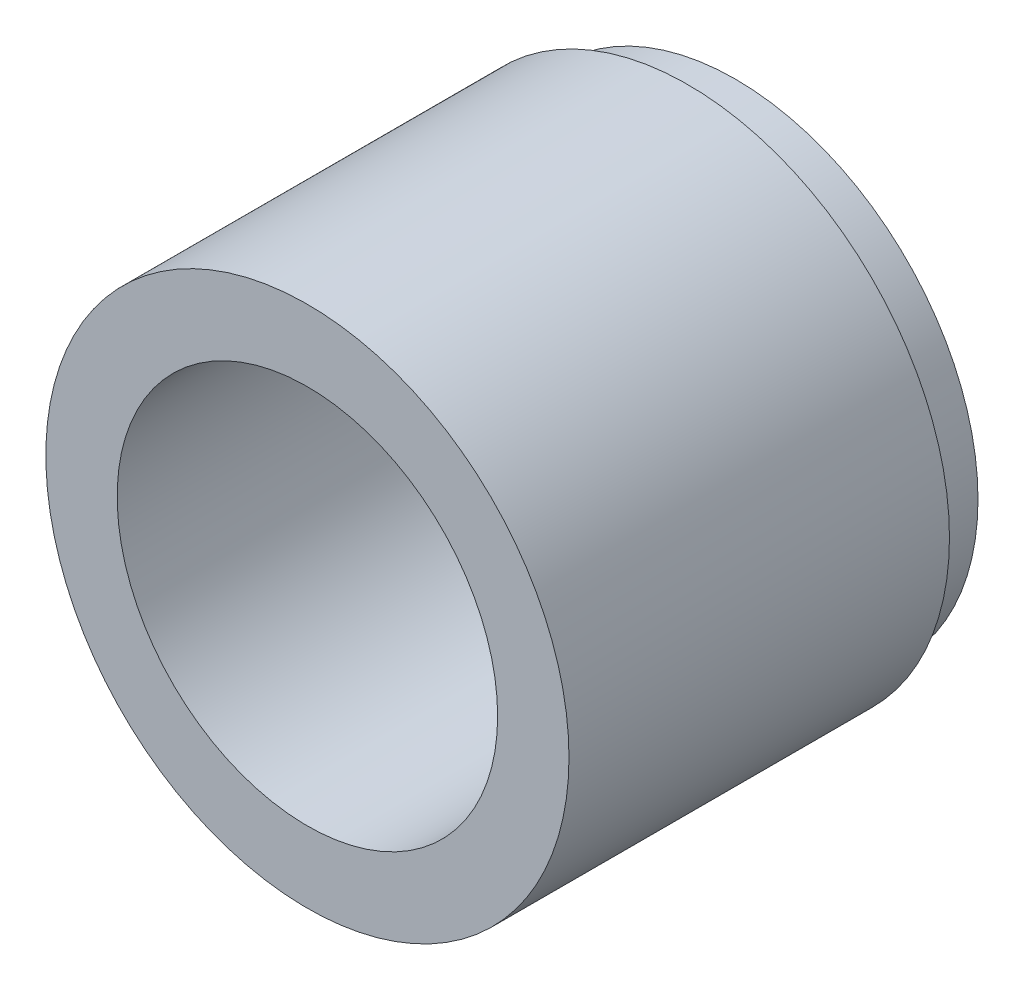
ISO-10303-21;
HEADER;
FILE_DESCRIPTION(('STEP AP214'),'2;1');
FILE_NAME('part.step','',(''),(''),'','','');
FILE_SCHEMA(('AUTOMOTIVE_DESIGN { 1 0 10303 214 1 1 1 1 }'));
ENDSEC;
DATA;
#1=APPLICATION_CONTEXT('core data for automotive mechanical design processes');
#2=APPLICATION_PROTOCOL_DEFINITION('international standard','automotive_design',2000,#1);
#3=PRODUCT_CONTEXT('',#1,'mechanical');
#4=PRODUCT('Part','Part','',(#3));
#5=PRODUCT_RELATED_PRODUCT_CATEGORY('part','',(#4));
#6=PRODUCT_DEFINITION_FORMATION('','',#4);
#7=PRODUCT_DEFINITION_CONTEXT('part definition',#1,'design');
#8=PRODUCT_DEFINITION('design','',#6,#7);
#9=PRODUCT_DEFINITION_SHAPE('','',#8);
#10=(LENGTH_UNIT() NAMED_UNIT(*) SI_UNIT(.MILLI.,.METRE.));
#11=(NAMED_UNIT(*) PLANE_ANGLE_UNIT() SI_UNIT($,.RADIAN.));
#12=(NAMED_UNIT(*) SI_UNIT($,.STERADIAN.) SOLID_ANGLE_UNIT());
#13=UNCERTAINTY_MEASURE_WITH_UNIT(LENGTH_MEASURE(1.E-05),#10,'distance_accuracy_value','');
#14=(GEOMETRIC_REPRESENTATION_CONTEXT(3) GLOBAL_UNCERTAINTY_ASSIGNED_CONTEXT((#13)) GLOBAL_UNIT_ASSIGNED_CONTEXT((#10,
#11,#12)) REPRESENTATION_CONTEXT('',''));
#15=CARTESIAN_POINT('',(0.,0.,0.));
#16=DIRECTION('',(0.,0.,1.));
#17=DIRECTION('',(1.,0.,0.));
#18=AXIS2_PLACEMENT_3D('',#15,#16,#17);
#19=CARTESIAN_POINT('',(0.,0.,40.));
#20=DIRECTION('',(0.,0.,-1.));
#21=DIRECTION('',(-1.,0.,0.));
#22=AXIS2_PLACEMENT_3D('',#19,#20,#21);
#23=CYLINDRICAL_SURFACE('',#22,27.5);
#24=CARTESIAN_POINT('',(0.,0.,40.));
#25=DIRECTION('',(0.,0.,1.));
#26=DIRECTION('',(1.,0.,0.));
#27=AXIS2_PLACEMENT_3D('',#24,#25,#26);
#28=CIRCLE('',#27,27.5);
#29=CARTESIAN_POINT('',(27.5,0.,40.));
#30=VERTEX_POINT('',#29);
#31=EDGE_CURVE('E36',#30,#30,#28,.T.);
#32=ORIENTED_EDGE('',*,*,#31,.F.);
#33=EDGE_LOOP('',(#32));
#34=FACE_BOUND('',#33,.T.);
#35=CARTESIAN_POINT('',(0.,0.,0.));
#36=DIRECTION('',(0.,0.,1.));
#37=DIRECTION('',(1.,0.,0.));
#38=AXIS2_PLACEMENT_3D('',#35,#36,#37);
#39=CIRCLE('',#38,27.5);
#40=CARTESIAN_POINT('',(27.5,0.,0.));
#41=VERTEX_POINT('',#40);
#42=EDGE_CURVE('E40',#41,#41,#39,.T.);
#43=ORIENTED_EDGE('',*,*,#42,.T.);
#44=EDGE_LOOP('',(#43));
#45=FACE_BOUND('',#44,.T.);
#46=ADVANCED_FACE('F30',(#34,#45),#23,.T.);
#47=CARTESIAN_POINT('',(0.,0.,40.));
#48=DIRECTION('',(0.,0.,1.));
#49=DIRECTION('',(1.,0.,0.));
#50=AXIS2_PLACEMENT_3D('',#47,#48,#49);
#51=PLANE('',#50);
#52=CARTESIAN_POINT('',(0.,0.,40.));
#53=DIRECTION('',(0.,0.,1.));
#54=DIRECTION('',(1.,0.,0.));
#55=AXIS2_PLACEMENT_3D('',#52,#53,#54);
#56=CIRCLE('',#55,20.);
#57=CARTESIAN_POINT('',(20.,0.,40.));
#58=VERTEX_POINT('',#57);
#59=EDGE_CURVE('E47',#58,#58,#56,.T.);
#60=ORIENTED_EDGE('',*,*,#59,.F.);
#61=EDGE_LOOP('',(#60));
#62=FACE_BOUND('',#61,.T.);
#63=ORIENTED_EDGE('',*,*,#31,.T.);
#64=EDGE_LOOP('',(#63));
#65=FACE_BOUND('',#64,.T.);
#66=ADVANCED_FACE('F81',(#62,#65),#51,.T.);
#67=CARTESIAN_POINT('',(0.,0.,0.));
#68=DIRECTION('',(0.,0.,1.));
#69=DIRECTION('',(1.,0.,0.));
#70=AXIS2_PLACEMENT_3D('',#67,#68,#69);
#71=PLANE('',#70);
#72=CARTESIAN_POINT('',(0.,0.,0.));
#73=DIRECTION('',(0.,0.,1.));
#74=DIRECTION('',(1.,0.,0.));
#75=AXIS2_PLACEMENT_3D('',#72,#73,#74);
#76=CIRCLE('',#75,25.5);
#77=CARTESIAN_POINT('',(25.5,0.,0.));
#78=VERTEX_POINT('',#77);
#79=EDGE_CURVE('E10',#78,#78,#76,.F.);
#80=ORIENTED_EDGE('',*,*,#79,.F.);
#81=EDGE_LOOP('',(#80));
#82=FACE_BOUND('',#81,.T.);
#83=ORIENTED_EDGE('',*,*,#42,.F.);
#84=EDGE_LOOP('',(#83));
#85=FACE_BOUND('',#84,.T.);
#86=ADVANCED_FACE('F86',(#82,#85),#71,.F.);
#87=CARTESIAN_POINT('',(0.,0.,6.));
#88=DIRECTION('',(0.,0.,1.));
#89=DIRECTION('',(1.,0.,0.));
#90=AXIS2_PLACEMENT_3D('',#87,#88,#89);
#91=CYLINDRICAL_SURFACE('',#90,20.);
#92=CARTESIAN_POINT('',(0.,0.,6.));
#93=DIRECTION('',(0.,0.,1.));
#94=DIRECTION('',(1.,0.,0.));
#95=AXIS2_PLACEMENT_3D('',#92,#93,#94);
#96=CIRCLE('',#95,20.);
#97=CARTESIAN_POINT('',(20.,0.,6.));
#98=VERTEX_POINT('',#97);
#99=EDGE_CURVE('E45',#98,#98,#96,.T.);
#100=ORIENTED_EDGE('',*,*,#99,.F.);
#101=EDGE_LOOP('',(#100));
#102=FACE_BOUND('',#101,.T.);
#103=ORIENTED_EDGE('',*,*,#59,.T.);
#104=EDGE_LOOP('',(#103));
#105=FACE_BOUND('',#104,.T.);
#106=ADVANCED_FACE('F77',(#102,#105),#91,.F.);
#107=CARTESIAN_POINT('',(0.,0.,6.));
#108=DIRECTION('',(0.,0.,1.));
#109=DIRECTION('',(1.,0.,0.));
#110=AXIS2_PLACEMENT_3D('',#107,#108,#109);
#111=PLANE('',#110);
#112=CARTESIAN_POINT('',(0.,0.,6.));
#113=DIRECTION('',(0.,0.,1.));
#114=DIRECTION('',(1.,0.,0.));
#115=AXIS2_PLACEMENT_3D('',#112,#113,#114);
#116=CIRCLE('',#115,18.);
#117=CARTESIAN_POINT('',(18.,0.,6.));
#118=VERTEX_POINT('',#117);
#119=EDGE_CURVE('E55',#118,#118,#116,.T.);
#120=ORIENTED_EDGE('',*,*,#119,.F.);
#121=EDGE_LOOP('',(#120));
#122=FACE_BOUND('',#121,.T.);
#123=ORIENTED_EDGE('',*,*,#99,.T.);
#124=EDGE_LOOP('',(#123));
#125=FACE_BOUND('',#124,.T.);
#126=ADVANCED_FACE('F72',(#122,#125),#111,.T.);
#127=CARTESIAN_POINT('',(0.,0.,-5.));
#128=DIRECTION('',(0.,0.,1.));
#129=DIRECTION('',(1.,0.,0.));
#130=AXIS2_PLACEMENT_3D('',#127,#128,#129);
#131=CYLINDRICAL_SURFACE('',#130,25.5);
#132=CARTESIAN_POINT('',(0.,0.,-5.));
#133=DIRECTION('',(0.,0.,-1.));
#134=DIRECTION('',(-1.,0.,0.));
#135=AXIS2_PLACEMENT_3D('',#132,#133,#134);
#136=CIRCLE('',#135,25.5);
#137=CARTESIAN_POINT('',(-25.5,0.,-5.));
#138=VERTEX_POINT('',#137);
#139=EDGE_CURVE('E50',#138,#138,#136,.T.);
#140=ORIENTED_EDGE('',*,*,#139,.F.);
#141=EDGE_LOOP('',(#140));
#142=FACE_BOUND('',#141,.T.);
#143=ORIENTED_EDGE('',*,*,#79,.T.);
#144=EDGE_LOOP('',(#143));
#145=FACE_BOUND('',#144,.T.);
#146=ADVANCED_FACE('F67',(#142,#145),#131,.T.);
#147=CARTESIAN_POINT('',(0.,0.,-5.));
#148=DIRECTION('',(0.,0.,-1.));
#149=DIRECTION('',(-1.,0.,0.));
#150=AXIS2_PLACEMENT_3D('',#147,#148,#149);
#151=PLANE('',#150);
#152=CARTESIAN_POINT('',(0.,0.,-5.));
#153=DIRECTION('',(0.,0.,-1.));
#154=DIRECTION('',(-1.,0.,0.));
#155=AXIS2_PLACEMENT_3D('',#152,#153,#154);
#156=CIRCLE('',#155,18.);
#157=CARTESIAN_POINT('',(-18.,0.,-5.));
#158=VERTEX_POINT('',#157);
#159=EDGE_CURVE('E58',#158,#158,#156,.T.);
#160=ORIENTED_EDGE('',*,*,#159,.F.);
#161=EDGE_LOOP('',(#160));
#162=FACE_BOUND('',#161,.T.);
#163=ORIENTED_EDGE('',*,*,#139,.T.);
#164=EDGE_LOOP('',(#163));
#165=FACE_BOUND('',#164,.T.);
#166=ADVANCED_FACE('F64',(#162,#165),#151,.T.);
#167=CARTESIAN_POINT('',(0.,0.,25.));
#168=DIRECTION('',(0.,0.,-1.));
#169=DIRECTION('',(-1.,0.,0.));
#170=AXIS2_PLACEMENT_3D('',#167,#168,#169);
#171=CYLINDRICAL_SURFACE('',#170,18.);
#172=ORIENTED_EDGE('',*,*,#119,.T.);
#173=EDGE_LOOP('',(#172));
#174=FACE_BOUND('',#173,.T.);
#175=ORIENTED_EDGE('',*,*,#159,.T.);
#176=EDGE_LOOP('',(#175));
#177=FACE_BOUND('',#176,.T.);
#178=ADVANCED_FACE('F62',(#174,#177),#171,.F.);
#179=CLOSED_SHELL('',(#46,#66,#86,#106,#126,#146,#166,#178));
#180=MANIFOLD_SOLID_BREP('B2',#179);
#181=ADVANCED_BREP_SHAPE_REPRESENTATION('',(#18,#180),#14);
#182=SHAPE_DEFINITION_REPRESENTATION(#9,#181);
ENDSEC;
END-ISO-10303-21;
